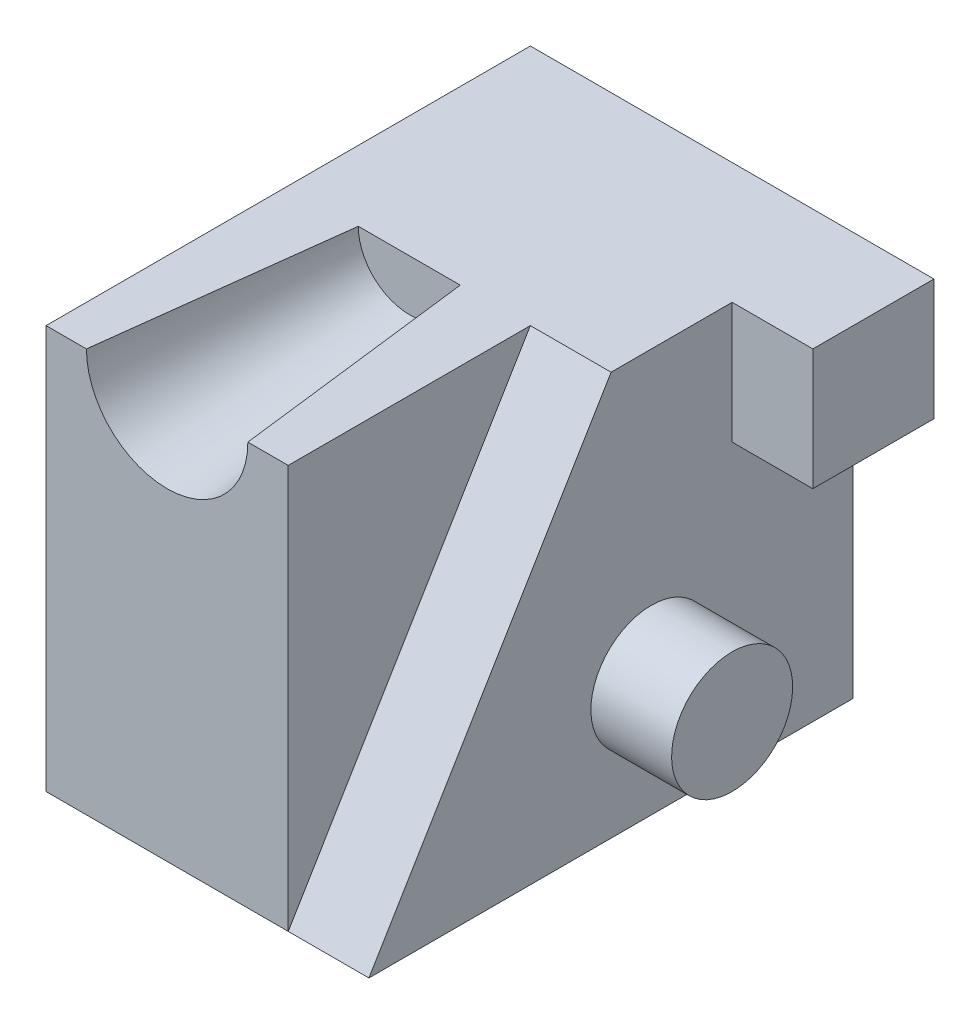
from build123d import *

# Parameters (mm, degrees)
SKETCH1_W           = 50
SKETCH1_H           = 50
EXTRUDE1_DEPTH      = 30
CUT_EXTRUDE1_DEPTH  = 20
SKETCH3_R           = 10
CUT_EXTRUDE2_DEPTH  = 30
CUT_EXTRUDE2_DRAFT  = -7
SKETCH4_OUTSIDE_W   = 80.548
SKETCH4_OUTSIDE_H   = 70.548
SKETCH4_OUTSIDE_R   = 7.5
SKETCH4_OUTSIDE_W_2 = 15
SKETCH4_OUTSIDE_H_2 = 15
CUT_EXTRUDE3_DEPTH  = 10


with BuildPart() as part:
    # Sketch1 → Extrude1 (new, symmetric)
    with BuildSketch(Plane.XY):
        with Locations((25, 25)):
            Rectangle(SKETCH1_W, SKETCH1_H)
    extrude(amount=EXTRUDE1_DEPTH, both=True)

    # Sketch2 → Cut-Extrude1 (cut)
    with BuildSketch(Plane(origin=(50, 0, 0), x_dir=(0, 0, -1), z_dir=(1, 0, 0))):
        Polygon((-30, 50), (0, 50), (-30, 0), align=None)
    extrude(amount=-CUT_EXTRUDE1_DEPTH, mode=Mode.SUBTRACT)


with BuildPart() as cut_extrude2_tool:
    # Sketch3 → Cut-Extrude2 (with draft: the straight prism first)
    with BuildSketch(Plane.XY.offset(30)):
        with Locations((15, 50)):
            Circle(SKETCH3_R)
    extrude(amount=-CUT_EXTRUDE2_DEPTH)
    # Cut-Extrude2: the draft: its side faces are tilted about the plane it starts from
    cut_extrude2_sides = [cut_extrude2_tool.faces().sort_by_distance(p)[0] for p in [
        (5, 50, 15),
    ]]
    draft(cut_extrude2_sides, Plane.XY.offset(30), CUT_EXTRUDE2_DRAFT)


with BuildPart() as part_1:
    add(part.part)

    # Cut-Extrude2: cut by cut_extrude2_tool
    add(cut_extrude2_tool.part, mode=Mode.SUBTRACT)

    # Sketch4 outside → Cut-Extrude3 (cut)
    with BuildSketch(Plane(origin=(50, 0, 0), x_dir=(0, 0, -1), z_dir=(1, 0, 0))):
        with Locations((0, 25)):
            Rectangle(SKETCH4_OUTSIDE_W, SKETCH4_OUTSIDE_H)
        with Locations(Location((5, 15, 0), (0, 0, 90))):
            Circle(SKETCH4_OUTSIDE_R, mode=Mode.SUBTRACT)
        with Locations((22.5, 42.5)):
            Rectangle(SKETCH4_OUTSIDE_W_2, SKETCH4_OUTSIDE_H_2, mode=Mode.SUBTRACT)
    extrude(amount=-CUT_EXTRUDE3_DEPTH, mode=Mode.SUBTRACT)


solid = part_1.part
